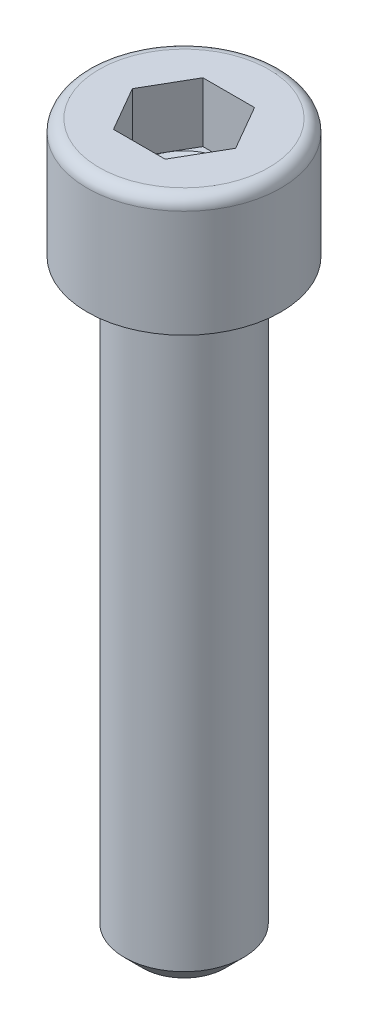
ISO-10303-21;
HEADER;
FILE_DESCRIPTION(('STEP AP214'),'2;1');
FILE_NAME('part.step','',(''),(''),'','','');
FILE_SCHEMA(('AUTOMOTIVE_DESIGN { 1 0 10303 214 1 1 1 1 }'));
ENDSEC;
DATA;
#1=APPLICATION_CONTEXT('core data for automotive mechanical design processes');
#2=APPLICATION_PROTOCOL_DEFINITION('international standard','automotive_design',2000,#1);
#3=PRODUCT_CONTEXT('',#1,'mechanical');
#4=PRODUCT('Part','Part','',(#3));
#5=PRODUCT_RELATED_PRODUCT_CATEGORY('part','',(#4));
#6=PRODUCT_DEFINITION_FORMATION('','',#4);
#7=PRODUCT_DEFINITION_CONTEXT('part definition',#1,'design');
#8=PRODUCT_DEFINITION('design','',#6,#7);
#9=PRODUCT_DEFINITION_SHAPE('','',#8);
#10=(LENGTH_UNIT() NAMED_UNIT(*) SI_UNIT(.MILLI.,.METRE.));
#11=(NAMED_UNIT(*) PLANE_ANGLE_UNIT() SI_UNIT($,.RADIAN.));
#12=(NAMED_UNIT(*) SI_UNIT($,.STERADIAN.) SOLID_ANGLE_UNIT());
#13=UNCERTAINTY_MEASURE_WITH_UNIT(LENGTH_MEASURE(1.E-05),#10,'distance_accuracy_value','');
#14=(GEOMETRIC_REPRESENTATION_CONTEXT(3) GLOBAL_UNCERTAINTY_ASSIGNED_CONTEXT((#13)) GLOBAL_UNIT_ASSIGNED_CONTEXT((#10,
#11,#12)) REPRESENTATION_CONTEXT('',''));
#15=CARTESIAN_POINT('',(0.,0.,0.));
#16=DIRECTION('',(0.,0.,1.));
#17=DIRECTION('',(1.,0.,0.));
#18=AXIS2_PLACEMENT_3D('',#15,#16,#17);
#19=CARTESIAN_POINT('',(3.,8.,0.));
#20=DIRECTION('',(0.,-1.,0.));
#21=DIRECTION('',(1.,0.,0.));
#22=AXIS2_PLACEMENT_3D('',#19,#20,#21);
#23=PLANE('',#22);
#24=CARTESIAN_POINT('',(0.,8.,0.));
#25=DIRECTION('',(0.,1.,0.));
#26=DIRECTION('',(-1.,0.,0.));
#27=AXIS2_PLACEMENT_3D('',#24,#25,#26);
#28=CIRCLE('',#27,5.7);
#29=CARTESIAN_POINT('',(-5.7,8.,0.));
#30=VERTEX_POINT('',#29);
#31=EDGE_CURVE('E139',#30,#30,#28,.T.);
#32=ORIENTED_EDGE('',*,*,#31,.T.);
#33=EDGE_LOOP('',(#32));
#34=FACE_BOUND('',#33,.T.);
#35=DIRECTION('',(0.499999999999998,0.,0.86602540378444));
#36=VECTOR('',#35,1.);
#37=CARTESIAN_POINT('',(1.73205080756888,8.,-3.));
#38=LINE('',#37,#36);
#39=CARTESIAN_POINT('',(1.73205080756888,8.,-3.));
#40=VERTEX_POINT('',#39);
#41=CARTESIAN_POINT('',(3.46410161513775,8.,0.));
#42=VERTEX_POINT('',#41);
#43=EDGE_CURVE('E371',#40,#42,#38,.T.);
#44=ORIENTED_EDGE('',*,*,#43,.T.);
#45=DIRECTION('',(-0.499999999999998,0.,0.86602540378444));
#46=VECTOR('',#45,1.);
#47=CARTESIAN_POINT('',(1.73205080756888,8.,3.));
#48=LINE('',#47,#46);
#49=CARTESIAN_POINT('',(1.73205080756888,8.,3.));
#50=VERTEX_POINT('',#49);
#51=EDGE_CURVE('E374',#42,#50,#48,.T.);
#52=ORIENTED_EDGE('',*,*,#51,.T.);
#53=DIRECTION('',(-1.,0.,0.));
#54=VECTOR('',#53,1.);
#55=CARTESIAN_POINT('',(1.73205080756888,8.,3.));
#56=LINE('',#55,#54);
#57=CARTESIAN_POINT('',(-1.73205080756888,8.,3.));
#58=VERTEX_POINT('',#57);
#59=EDGE_CURVE('E377',#50,#58,#56,.T.);
#60=ORIENTED_EDGE('',*,*,#59,.T.);
#61=DIRECTION('',(-0.499999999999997,0.,-0.86602540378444));
#62=VECTOR('',#61,1.);
#63=CARTESIAN_POINT('',(-1.73205080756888,8.,3.));
#64=LINE('',#63,#62);
#65=CARTESIAN_POINT('',(-3.46410161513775,8.,0.));
#66=VERTEX_POINT('',#65);
#67=EDGE_CURVE('E116',#58,#66,#64,.T.);
#68=ORIENTED_EDGE('',*,*,#67,.T.);
#69=DIRECTION('',(0.499999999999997,0.,-0.86602540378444));
#70=VECTOR('',#69,1.);
#71=CARTESIAN_POINT('',(-1.73205080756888,8.,-3.));
#72=LINE('',#71,#70);
#73=CARTESIAN_POINT('',(-1.73205080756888,8.,-3.));
#74=VERTEX_POINT('',#73);
#75=EDGE_CURVE('E368',#66,#74,#72,.T.);
#76=ORIENTED_EDGE('',*,*,#75,.T.);
#77=DIRECTION('',(1.,0.,0.));
#78=VECTOR('',#77,1.);
#79=CARTESIAN_POINT('',(1.73205080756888,8.,-3.));
#80=LINE('',#79,#78);
#81=EDGE_CURVE('E127',#74,#40,#80,.T.);
#82=ORIENTED_EDGE('',*,*,#81,.T.);
#83=EDGE_LOOP('',(#44,#52,#60,#68,#76,#82));
#84=FACE_BOUND('',#83,.T.);
#85=ADVANCED_FACE('F33',(#34,#84),#23,.F.);
#86=CARTESIAN_POINT('',(0.,-40.,0.));
#87=DIRECTION('',(0.,1.,0.));
#88=DIRECTION('',(0.,0.,1.));
#89=AXIS2_PLACEMENT_3D('',#86,#87,#88);
#90=CYLINDRICAL_SURFACE('',#89,4.);
#91=CARTESIAN_POINT('',(0.,-38.75,0.));
#92=DIRECTION('',(0.,1.,0.));
#93=DIRECTION('',(0.,0.,1.));
#94=AXIS2_PLACEMENT_3D('',#91,#92,#93);
#95=CIRCLE('',#94,4.);
#96=CARTESIAN_POINT('',(0.,-38.75,4.));
#97=VERTEX_POINT('',#96);
#98=EDGE_CURVE('E41',#97,#97,#95,.T.);
#99=ORIENTED_EDGE('',*,*,#98,.T.);
#100=EDGE_LOOP('',(#99));
#101=FACE_BOUND('',#100,.T.);
#102=CARTESIAN_POINT('',(0.,0.,0.));
#103=DIRECTION('',(0.,1.,0.));
#104=DIRECTION('',(0.,0.,1.));
#105=AXIS2_PLACEMENT_3D('',#102,#103,#104);
#106=CIRCLE('',#105,4.);
#107=CARTESIAN_POINT('',(0.,0.,4.));
#108=VERTEX_POINT('',#107);
#109=EDGE_CURVE('E149',#108,#108,#106,.T.);
#110=ORIENTED_EDGE('',*,*,#109,.F.);
#111=EDGE_LOOP('',(#110));
#112=FACE_BOUND('',#111,.T.);
#113=ADVANCED_FACE('F154',(#101,#112),#90,.T.);
#114=CARTESIAN_POINT('',(0.,-40.,0.));
#115=DIRECTION('',(0.,1.,0.));
#116=DIRECTION('',(0.,0.,1.));
#117=AXIS2_PLACEMENT_3D('',#114,#115,#116);
#118=PLANE('',#117);
#119=CARTESIAN_POINT('',(0.,-40.,0.));
#120=DIRECTION('',(0.,1.,0.));
#121=DIRECTION('',(0.,0.,1.));
#122=AXIS2_PLACEMENT_3D('',#119,#120,#121);
#123=CIRCLE('',#122,2.74999999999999);
#124=CARTESIAN_POINT('',(0.,-40.,2.74999999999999));
#125=VERTEX_POINT('',#124);
#126=EDGE_CURVE('E11',#125,#125,#123,.F.);
#127=ORIENTED_EDGE('',*,*,#126,.T.);
#128=EDGE_LOOP('',(#127));
#129=FACE_BOUND('',#128,.T.);
#130=ADVANCED_FACE('F159',(#129),#118,.F.);
#131=CARTESIAN_POINT('',(0.,-38.75,0.));
#132=DIRECTION('',(0.,1.,0.));
#133=DIRECTION('',(0.,0.,1.));
#134=AXIS2_PLACEMENT_3D('',#131,#132,#133);
#135=CONICAL_SURFACE('',#134,4.,0.785398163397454);
#136=ORIENTED_EDGE('',*,*,#126,.F.);
#137=EDGE_LOOP('',(#136));
#138=FACE_BOUND('',#137,.T.);
#139=ORIENTED_EDGE('',*,*,#98,.F.);
#140=EDGE_LOOP('',(#139));
#141=FACE_BOUND('',#140,.T.);
#142=ADVANCED_FACE('F35',(#138,#141),#135,.T.);
#143=CARTESIAN_POINT('',(0.,0.,0.));
#144=DIRECTION('',(0.,1.,0.));
#145=DIRECTION('',(-1.,0.,0.));
#146=AXIS2_PLACEMENT_3D('',#143,#144,#145);
#147=PLANE('',#146);
#148=ORIENTED_EDGE('',*,*,#109,.T.);
#149=EDGE_LOOP('',(#148));
#150=FACE_BOUND('',#149,.T.);
#151=CARTESIAN_POINT('',(0.,0.,0.));
#152=DIRECTION('',(0.,1.,0.));
#153=DIRECTION('',(-1.,0.,0.));
#154=AXIS2_PLACEMENT_3D('',#151,#152,#153);
#155=CIRCLE('',#154,6.5);
#156=CARTESIAN_POINT('',(-6.5,0.,0.));
#157=VERTEX_POINT('',#156);
#158=EDGE_CURVE('E146',#157,#157,#155,.T.);
#159=ORIENTED_EDGE('',*,*,#158,.F.);
#160=EDGE_LOOP('',(#159));
#161=FACE_BOUND('',#160,.T.);
#162=ADVANCED_FACE('F158',(#150,#161),#147,.F.);
#163=CARTESIAN_POINT('',(0.,8.,0.));
#164=DIRECTION('',(0.,1.,0.));
#165=DIRECTION('',(-1.,0.,0.));
#166=AXIS2_PLACEMENT_3D('',#163,#164,#165);
#167=CYLINDRICAL_SURFACE('',#166,6.5);
#168=CARTESIAN_POINT('',(0.,7.2,0.));
#169=DIRECTION('',(0.,1.,0.));
#170=DIRECTION('',(-1.,0.,0.));
#171=AXIS2_PLACEMENT_3D('',#168,#169,#170);
#172=CIRCLE('',#171,6.5);
#173=CARTESIAN_POINT('',(-6.5,7.2,0.));
#174=VERTEX_POINT('',#173);
#175=EDGE_CURVE('E143',#174,#174,#172,.T.);
#176=ORIENTED_EDGE('',*,*,#175,.F.);
#177=EDGE_LOOP('',(#176));
#178=FACE_BOUND('',#177,.T.);
#179=ORIENTED_EDGE('',*,*,#158,.T.);
#180=EDGE_LOOP('',(#179));
#181=FACE_BOUND('',#180,.T.);
#182=ADVANCED_FACE('F165',(#178,#181),#167,.T.);
#183=CARTESIAN_POINT('',(0.,7.2,0.));
#184=DIRECTION('',(0.,1.,0.));
#185=DIRECTION('',(-1.,0.,0.));
#186=AXIS2_PLACEMENT_3D('',#183,#184,#185);
#187=TOROIDAL_SURFACE('',#186,5.7,0.8);
#188=ORIENTED_EDGE('',*,*,#31,.F.);
#189=EDGE_LOOP('',(#188));
#190=FACE_BOUND('',#189,.T.);
#191=ORIENTED_EDGE('',*,*,#175,.T.);
#192=EDGE_LOOP('',(#191));
#193=FACE_BOUND('',#192,.T.);
#194=ADVANCED_FACE('F182',(#190,#193),#187,.T.);
#195=CARTESIAN_POINT('',(-1.73205080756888,4.,-3.));
#196=DIRECTION('',(0.86602540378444,0.,0.499999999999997));
#197=DIRECTION('',(0.499999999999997,0.,-0.86602540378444));
#198=AXIS2_PLACEMENT_3D('',#195,#196,#197);
#199=PLANE('',#198);
#200=ORIENTED_EDGE('',*,*,#75,.F.);
#201=DIRECTION('',(0.,1.,0.));
#202=VECTOR('',#201,1.);
#203=CARTESIAN_POINT('',(-3.46410161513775,4.,0.));
#204=LINE('',#203,#202);
#205=CARTESIAN_POINT('',(-3.46410161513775,4.,0.));
#206=VERTEX_POINT('',#205);
#207=EDGE_CURVE('E363',#206,#66,#204,.T.);
#208=ORIENTED_EDGE('',*,*,#207,.F.);
#209=DIRECTION('',(0.499999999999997,0.,-0.86602540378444));
#210=VECTOR('',#209,1.);
#211=CARTESIAN_POINT('',(-1.73205080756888,4.,-3.));
#212=LINE('',#211,#210);
#213=CARTESIAN_POINT('',(-2.59807621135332,4.,-1.49999999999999));
#214=VERTEX_POINT('',#213);
#215=EDGE_CURVE('E112',#206,#214,#212,.T.);
#216=ORIENTED_EDGE('',*,*,#215,.T.);
#217=CARTESIAN_POINT('',(-1.73205080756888,4.,-3.));
#218=VERTEX_POINT('',#217);
#219=EDGE_CURVE('E106',#214,#218,#212,.T.);
#220=ORIENTED_EDGE('',*,*,#219,.T.);
#221=DIRECTION('',(0.,1.,0.));
#222=VECTOR('',#221,1.);
#223=CARTESIAN_POINT('',(-1.73205080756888,4.,-3.));
#224=LINE('',#223,#222);
#225=EDGE_CURVE('E108',#218,#74,#224,.T.);
#226=ORIENTED_EDGE('',*,*,#225,.T.);
#227=EDGE_LOOP('',(#200,#208,#216,#220,#226));
#228=FACE_BOUND('',#227,.T.);
#229=ADVANCED_FACE('F107',(#228),#199,.T.);
#230=CARTESIAN_POINT('',(1.73205080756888,4.,-3.));
#231=DIRECTION('',(0.,0.,1.));
#232=DIRECTION('',(1.,0.,0.));
#233=AXIS2_PLACEMENT_3D('',#230,#231,#232);
#234=PLANE('',#233);
#235=ORIENTED_EDGE('',*,*,#81,.F.);
#236=ORIENTED_EDGE('',*,*,#225,.F.);
#237=DIRECTION('',(1.,0.,0.));
#238=VECTOR('',#237,1.);
#239=CARTESIAN_POINT('',(1.73205080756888,4.,-3.));
#240=LINE('',#239,#238);
#241=CARTESIAN_POINT('',(0.,4.,-3.));
#242=VERTEX_POINT('',#241);
#243=EDGE_CURVE('E48',#218,#242,#240,.T.);
#244=ORIENTED_EDGE('',*,*,#243,.T.);
#245=CARTESIAN_POINT('',(1.73205080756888,4.,-3.));
#246=VERTEX_POINT('',#245);
#247=EDGE_CURVE('E122',#242,#246,#240,.T.);
#248=ORIENTED_EDGE('',*,*,#247,.T.);
#249=DIRECTION('',(0.,1.,0.));
#250=VECTOR('',#249,1.);
#251=CARTESIAN_POINT('',(1.73205080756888,4.,-3.));
#252=LINE('',#251,#250);
#253=EDGE_CURVE('E129',#246,#40,#252,.T.);
#254=ORIENTED_EDGE('',*,*,#253,.T.);
#255=EDGE_LOOP('',(#235,#236,#244,#248,#254));
#256=FACE_BOUND('',#255,.T.);
#257=ADVANCED_FACE('F124',(#256),#234,.T.);
#258=CARTESIAN_POINT('',(1.73205080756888,4.,-3.));
#259=DIRECTION('',(-0.86602540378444,0.,0.499999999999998));
#260=DIRECTION('',(0.499999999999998,0.,0.86602540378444));
#261=AXIS2_PLACEMENT_3D('',#258,#259,#260);
#262=PLANE('',#261);
#263=ORIENTED_EDGE('',*,*,#43,.F.);
#264=ORIENTED_EDGE('',*,*,#253,.F.);
#265=DIRECTION('',(0.499999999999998,0.,0.86602540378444));
#266=VECTOR('',#265,1.);
#267=CARTESIAN_POINT('',(1.73205080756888,4.,-3.));
#268=LINE('',#267,#266);
#269=CARTESIAN_POINT('',(2.59807621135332,4.,-1.49999999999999));
#270=VERTEX_POINT('',#269);
#271=EDGE_CURVE('E396',#246,#270,#268,.T.);
#272=ORIENTED_EDGE('',*,*,#271,.T.);
#273=CARTESIAN_POINT('',(3.46410161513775,4.,0.));
#274=VERTEX_POINT('',#273);
#275=EDGE_CURVE('E121',#270,#274,#268,.T.);
#276=ORIENTED_EDGE('',*,*,#275,.T.);
#277=DIRECTION('',(0.,1.,0.));
#278=VECTOR('',#277,1.);
#279=CARTESIAN_POINT('',(3.46410161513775,4.,0.));
#280=LINE('',#279,#278);
#281=EDGE_CURVE('E134',#274,#42,#280,.T.);
#282=ORIENTED_EDGE('',*,*,#281,.T.);
#283=EDGE_LOOP('',(#263,#264,#272,#276,#282));
#284=FACE_BOUND('',#283,.T.);
#285=ADVANCED_FACE('F212',(#284),#262,.T.);
#286=CARTESIAN_POINT('',(1.73205080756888,4.,3.));
#287=DIRECTION('',(-0.86602540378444,0.,-0.499999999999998));
#288=DIRECTION('',(-0.499999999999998,0.,0.86602540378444));
#289=AXIS2_PLACEMENT_3D('',#286,#287,#288);
#290=PLANE('',#289);
#291=ORIENTED_EDGE('',*,*,#51,.F.);
#292=ORIENTED_EDGE('',*,*,#281,.F.);
#293=DIRECTION('',(-0.499999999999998,0.,0.86602540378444));
#294=VECTOR('',#293,1.);
#295=CARTESIAN_POINT('',(1.73205080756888,4.,3.));
#296=LINE('',#295,#294);
#297=CARTESIAN_POINT('',(2.59807621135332,4.,1.49999999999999));
#298=VERTEX_POINT('',#297);
#299=EDGE_CURVE('E394',#274,#298,#296,.T.);
#300=ORIENTED_EDGE('',*,*,#299,.T.);
#301=CARTESIAN_POINT('',(1.73205080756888,4.,3.));
#302=VERTEX_POINT('',#301);
#303=EDGE_CURVE('E395',#298,#302,#296,.T.);
#304=ORIENTED_EDGE('',*,*,#303,.T.);
#305=DIRECTION('',(0.,1.,0.));
#306=VECTOR('',#305,1.);
#307=CARTESIAN_POINT('',(1.73205080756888,4.,3.));
#308=LINE('',#307,#306);
#309=EDGE_CURVE('E383',#302,#50,#308,.T.);
#310=ORIENTED_EDGE('',*,*,#309,.T.);
#311=EDGE_LOOP('',(#291,#292,#300,#304,#310));
#312=FACE_BOUND('',#311,.T.);
#313=ADVANCED_FACE('F219',(#312),#290,.T.);
#314=CARTESIAN_POINT('',(1.73205080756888,4.,3.));
#315=DIRECTION('',(0.,0.,-1.));
#316=DIRECTION('',(-1.,0.,0.));
#317=AXIS2_PLACEMENT_3D('',#314,#315,#316);
#318=PLANE('',#317);
#319=ORIENTED_EDGE('',*,*,#59,.F.);
#320=ORIENTED_EDGE('',*,*,#309,.F.);
#321=DIRECTION('',(-1.,0.,0.));
#322=VECTOR('',#321,1.);
#323=CARTESIAN_POINT('',(1.73205080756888,4.,3.));
#324=LINE('',#323,#322);
#325=CARTESIAN_POINT('',(0.,4.,3.));
#326=VERTEX_POINT('',#325);
#327=EDGE_CURVE('E358',#302,#326,#324,.T.);
#328=ORIENTED_EDGE('',*,*,#327,.T.);
#329=CARTESIAN_POINT('',(-1.73205080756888,4.,3.));
#330=VERTEX_POINT('',#329);
#331=EDGE_CURVE('E354',#326,#330,#324,.T.);
#332=ORIENTED_EDGE('',*,*,#331,.T.);
#333=DIRECTION('',(0.,1.,0.));
#334=VECTOR('',#333,1.);
#335=CARTESIAN_POINT('',(-1.73205080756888,4.,3.));
#336=LINE('',#335,#334);
#337=EDGE_CURVE('E362',#330,#58,#336,.T.);
#338=ORIENTED_EDGE('',*,*,#337,.T.);
#339=EDGE_LOOP('',(#319,#320,#328,#332,#338));
#340=FACE_BOUND('',#339,.T.);
#341=ADVANCED_FACE('F227',(#340),#318,.T.);
#342=CARTESIAN_POINT('',(-1.73205080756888,4.,3.));
#343=DIRECTION('',(0.86602540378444,0.,-0.499999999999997));
#344=DIRECTION('',(-0.499999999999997,0.,-0.86602540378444));
#345=AXIS2_PLACEMENT_3D('',#342,#343,#344);
#346=PLANE('',#345);
#347=ORIENTED_EDGE('',*,*,#67,.F.);
#348=ORIENTED_EDGE('',*,*,#337,.F.);
#349=DIRECTION('',(-0.499999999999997,0.,-0.86602540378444));
#350=VECTOR('',#349,1.);
#351=CARTESIAN_POINT('',(-1.73205080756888,4.,3.));
#352=LINE('',#351,#350);
#353=CARTESIAN_POINT('',(-2.59807621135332,4.,1.49999999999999));
#354=VERTEX_POINT('',#353);
#355=EDGE_CURVE('E353',#330,#354,#352,.T.);
#356=ORIENTED_EDGE('',*,*,#355,.T.);
#357=EDGE_CURVE('E356',#354,#206,#352,.T.);
#358=ORIENTED_EDGE('',*,*,#357,.T.);
#359=ORIENTED_EDGE('',*,*,#207,.T.);
#360=EDGE_LOOP('',(#347,#348,#356,#358,#359));
#361=FACE_BOUND('',#360,.T.);
#362=ADVANCED_FACE('F235',(#361),#346,.T.);
#363=CARTESIAN_POINT('',(-5.19615242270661,4.,3.));
#364=DIRECTION('',(0.,-1.,0.));
#365=DIRECTION('',(0.,0.,-1.));
#366=AXIS2_PLACEMENT_3D('',#363,#364,#365);
#367=PLANE('',#366);
#368=ORIENTED_EDGE('',*,*,#243,.F.);
#369=ORIENTED_EDGE('',*,*,#219,.F.);
#370=CARTESIAN_POINT('',(0.,4.,0.));
#371=DIRECTION('',(0.,1.,0.));
#372=DIRECTION('',(-1.,0.,0.));
#373=AXIS2_PLACEMENT_3D('',#370,#371,#372);
#374=CIRCLE('',#373,3.);
#375=EDGE_CURVE('E119',#242,#214,#374,.T.);
#376=ORIENTED_EDGE('',*,*,#375,.F.);
#377=EDGE_LOOP('',(#368,#369,#376));
#378=FACE_BOUND('',#377,.T.);
#379=ADVANCED_FACE('F118',(#378),#367,.F.);
#380=ORIENTED_EDGE('',*,*,#215,.F.);
#381=ORIENTED_EDGE('',*,*,#357,.F.);
#382=EDGE_CURVE('E128',#214,#354,#374,.T.);
#383=ORIENTED_EDGE('',*,*,#382,.F.);
#384=EDGE_LOOP('',(#380,#381,#383));
#385=FACE_BOUND('',#384,.T.);
#386=ADVANCED_FACE('F250',(#385),#367,.F.);
#387=ORIENTED_EDGE('',*,*,#355,.F.);
#388=ORIENTED_EDGE('',*,*,#331,.F.);
#389=EDGE_CURVE('E133',#354,#326,#374,.T.);
#390=ORIENTED_EDGE('',*,*,#389,.F.);
#391=EDGE_LOOP('',(#387,#388,#390));
#392=FACE_BOUND('',#391,.T.);
#393=ADVANCED_FACE('F258',(#392),#367,.F.);
#394=ORIENTED_EDGE('',*,*,#327,.F.);
#395=ORIENTED_EDGE('',*,*,#303,.F.);
#396=EDGE_CURVE('E140',#326,#298,#374,.T.);
#397=ORIENTED_EDGE('',*,*,#396,.F.);
#398=EDGE_LOOP('',(#394,#395,#397));
#399=FACE_BOUND('',#398,.T.);
#400=ADVANCED_FACE('F265',(#399),#367,.F.);
#401=ORIENTED_EDGE('',*,*,#299,.F.);
#402=ORIENTED_EDGE('',*,*,#275,.F.);
#403=EDGE_CURVE('E400',#298,#270,#374,.T.);
#404=ORIENTED_EDGE('',*,*,#403,.F.);
#405=EDGE_LOOP('',(#401,#402,#404));
#406=FACE_BOUND('',#405,.T.);
#407=ADVANCED_FACE('F272',(#406),#367,.F.);
#408=ORIENTED_EDGE('',*,*,#271,.F.);
#409=ORIENTED_EDGE('',*,*,#247,.F.);
#410=EDGE_CURVE('E399',#270,#242,#374,.T.);
#411=ORIENTED_EDGE('',*,*,#410,.F.);
#412=EDGE_LOOP('',(#408,#409,#411));
#413=FACE_BOUND('',#412,.T.);
#414=ADVANCED_FACE('F252',(#413),#367,.F.);
#415=CARTESIAN_POINT('',(0.,4.,0.));
#416=DIRECTION('',(0.,1.,0.));
#417=DIRECTION('',(-1.,0.,0.));
#418=AXIS2_PLACEMENT_3D('',#415,#416,#417);
#419=CONICAL_SURFACE('',#418,3.,1.04719755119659);
#420=CARTESIAN_POINT('',(0.,2.2679491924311,0.));
#421=VERTEX_POINT('',#420);
#422=VERTEX_LOOP('',#421);
#423=FACE_BOUND('',#422,.T.);
#424=ORIENTED_EDGE('',*,*,#389,.T.);
#425=ORIENTED_EDGE('',*,*,#396,.T.);
#426=ORIENTED_EDGE('',*,*,#403,.T.);
#427=ORIENTED_EDGE('',*,*,#410,.T.);
#428=ORIENTED_EDGE('',*,*,#375,.T.);
#429=ORIENTED_EDGE('',*,*,#382,.T.);
#430=EDGE_LOOP('',(#424,#425,#426,#427,#428,#429));
#431=FACE_BOUND('',#430,.T.);
#432=ADVANCED_FACE('F180',(#423,#431),#419,.F.);
#433=CLOSED_SHELL('',(#85,#113,#130,#142,#162,#182,#194,#229,#257,#285,#313,#341,#362,#379,#386,
#393,#400,#407,#414,#432));
#434=MANIFOLD_SOLID_BREP('B2',#433);
#435=ADVANCED_BREP_SHAPE_REPRESENTATION('',(#18,#434),#14);
#436=SHAPE_DEFINITION_REPRESENTATION(#9,#435);
ENDSEC;
END-ISO-10303-21;
